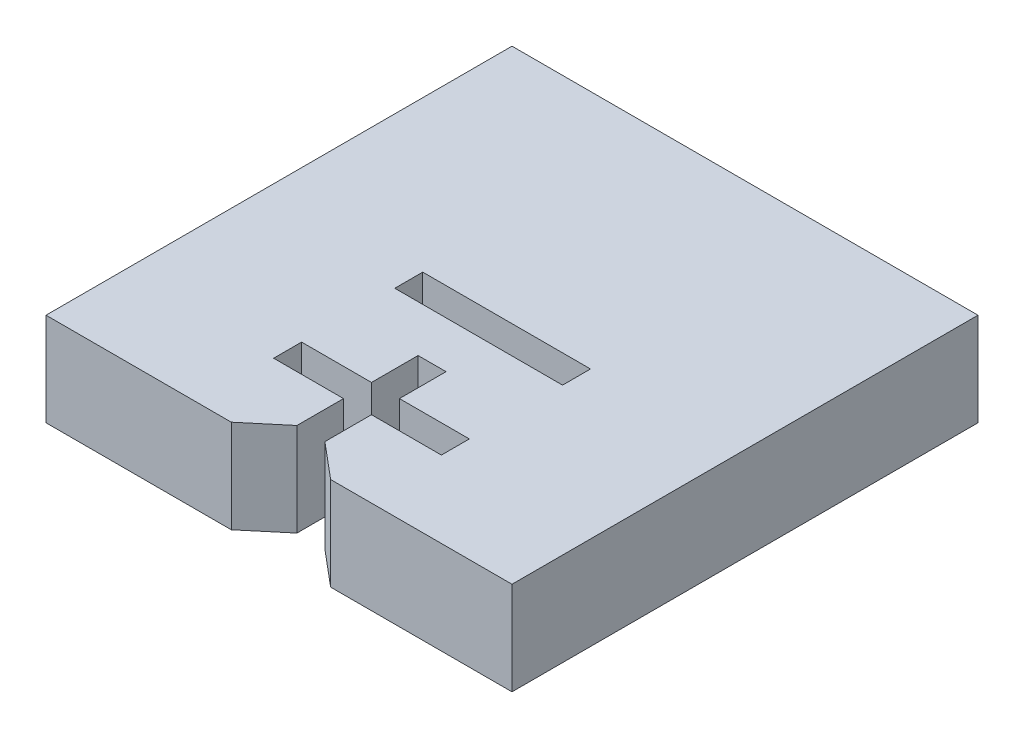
ISO-10303-21;
HEADER;
FILE_DESCRIPTION(('STEP AP214'),'2;1');
FILE_NAME('part.step','',(''),(''),'','','');
FILE_SCHEMA(('AUTOMOTIVE_DESIGN { 1 0 10303 214 1 1 1 1 }'));
ENDSEC;
DATA;
#1=APPLICATION_CONTEXT('core data for automotive mechanical design processes');
#2=APPLICATION_PROTOCOL_DEFINITION('international standard','automotive_design',2000,#1);
#3=PRODUCT_CONTEXT('',#1,'mechanical');
#4=PRODUCT('Part','Part','',(#3));
#5=PRODUCT_RELATED_PRODUCT_CATEGORY('part','',(#4));
#6=PRODUCT_DEFINITION_FORMATION('','',#4);
#7=PRODUCT_DEFINITION_CONTEXT('part definition',#1,'design');
#8=PRODUCT_DEFINITION('design','',#6,#7);
#9=PRODUCT_DEFINITION_SHAPE('','',#8);
#10=(LENGTH_UNIT() NAMED_UNIT(*) SI_UNIT(.MILLI.,.METRE.));
#11=(NAMED_UNIT(*) PLANE_ANGLE_UNIT() SI_UNIT($,.RADIAN.));
#12=(NAMED_UNIT(*) SI_UNIT($,.STERADIAN.) SOLID_ANGLE_UNIT());
#13=UNCERTAINTY_MEASURE_WITH_UNIT(LENGTH_MEASURE(1.E-05),#10,'distance_accuracy_value','');
#14=(GEOMETRIC_REPRESENTATION_CONTEXT(3) GLOBAL_UNCERTAINTY_ASSIGNED_CONTEXT((#13)) GLOBAL_UNIT_ASSIGNED_CONTEXT((#10,
#11,#12)) REPRESENTATION_CONTEXT('',''));
#15=CARTESIAN_POINT('',(0.,0.,0.));
#16=DIRECTION('',(0.,0.,1.));
#17=DIRECTION('',(1.,0.,0.));
#18=AXIS2_PLACEMENT_3D('',#15,#16,#17);
#19=CARTESIAN_POINT('',(0.,10.,-54.5836991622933));
#20=DIRECTION('',(0.,0.,-1.));
#21=DIRECTION('',(-1.,0.,0.));
#22=AXIS2_PLACEMENT_3D('',#19,#20,#21);
#23=PLANE('',#22);
#24=DIRECTION('',(1.,0.,0.));
#25=VECTOR('',#24,1.);
#26=CARTESIAN_POINT('',(0.,0.,-54.5836991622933));
#27=LINE('',#26,#25);
#28=CARTESIAN_POINT('',(-30.9988969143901,0.,-54.5836991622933));
#29=VERTEX_POINT('',#28);
#30=CARTESIAN_POINT('',(-11.1193788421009,0.,-54.5836991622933));
#31=VERTEX_POINT('',#30);
#32=EDGE_CURVE('E233',#29,#31,#27,.T.);
#33=ORIENTED_EDGE('',*,*,#32,.T.);
#34=DIRECTION('',(0.,-1.,0.));
#35=VECTOR('',#34,1.);
#36=CARTESIAN_POINT('',(-11.1193788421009,10.,-54.5836991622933));
#37=LINE('',#36,#35);
#38=CARTESIAN_POINT('',(-11.1193788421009,10.,-54.5836991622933));
#39=VERTEX_POINT('',#38);
#40=EDGE_CURVE('E11',#39,#31,#37,.T.);
#41=ORIENTED_EDGE('',*,*,#40,.F.);
#42=DIRECTION('',(1.,0.,0.));
#43=VECTOR('',#42,1.);
#44=CARTESIAN_POINT('',(0.,10.,-54.5836991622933));
#45=LINE('',#44,#43);
#46=CARTESIAN_POINT('',(-30.9988969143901,10.,-54.5836991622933));
#47=VERTEX_POINT('',#46);
#48=EDGE_CURVE('E422',#47,#39,#45,.T.);
#49=ORIENTED_EDGE('',*,*,#48,.F.);
#50=DIRECTION('',(0.,-1.,0.));
#51=VECTOR('',#50,1.);
#52=CARTESIAN_POINT('',(-30.9988969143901,10.,-54.5836991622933));
#53=LINE('',#52,#51);
#54=EDGE_CURVE('E54',#47,#29,#53,.T.);
#55=ORIENTED_EDGE('',*,*,#54,.T.);
#56=EDGE_LOOP('',(#33,#41,#49,#55));
#57=FACE_BOUND('',#56,.T.);
#58=ADVANCED_FACE('F35',(#57),#23,.F.);
#59=CARTESIAN_POINT('',(-31.4714845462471,10.,-37.5062547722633));
#60=DIRECTION('',(-0.642787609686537,0.,-0.76604444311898));
#61=DIRECTION('',(-0.76604444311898,0.,0.642787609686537));
#62=AXIS2_PLACEMENT_3D('',#59,#60,#61);
#63=PLANE('',#62);
#64=DIRECTION('',(0.76604444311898,0.,-0.642787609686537));
#65=VECTOR('',#64,1.);
#66=CARTESIAN_POINT('',(-31.4714845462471,0.,-37.5062547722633));
#67=LINE('',#66,#65);
#68=CARTESIAN_POINT('',(-7.28915662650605,0.,-57.797637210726));
#69=VERTEX_POINT('',#68);
#70=EDGE_CURVE('E235',#31,#69,#67,.T.);
#71=ORIENTED_EDGE('',*,*,#70,.T.);
#72=DIRECTION('',(0.,-1.,0.));
#73=VECTOR('',#72,1.);
#74=CARTESIAN_POINT('',(-7.28915662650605,10.,-57.797637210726));
#75=LINE('',#74,#73);
#76=CARTESIAN_POINT('',(-7.28915662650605,10.,-57.797637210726));
#77=VERTEX_POINT('',#76);
#78=EDGE_CURVE('E45',#77,#69,#75,.T.);
#79=ORIENTED_EDGE('',*,*,#78,.F.);
#80=DIRECTION('',(0.76604444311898,0.,-0.642787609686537));
#81=VECTOR('',#80,1.);
#82=CARTESIAN_POINT('',(-31.4714845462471,10.,-37.5062547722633));
#83=LINE('',#82,#81);
#84=EDGE_CURVE('E424',#39,#77,#83,.T.);
#85=ORIENTED_EDGE('',*,*,#84,.F.);
#86=ORIENTED_EDGE('',*,*,#40,.T.);
#87=EDGE_LOOP('',(#71,#79,#85,#86));
#88=FACE_BOUND('',#87,.T.);
#89=ADVANCED_FACE('F344',(#88),#63,.F.);
#90=CARTESIAN_POINT('',(-7.28915662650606,10.,0.));
#91=DIRECTION('',(-1.,0.,0.));
#92=DIRECTION('',(0.,0.,1.));
#93=AXIS2_PLACEMENT_3D('',#90,#91,#92);
#94=PLANE('',#93);
#95=DIRECTION('',(0.,0.,-1.));
#96=VECTOR('',#95,1.);
#97=CARTESIAN_POINT('',(-7.28915662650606,0.,0.));
#98=LINE('',#97,#96);
#99=CARTESIAN_POINT('',(-7.28915662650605,0.,-62.797637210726));
#100=VERTEX_POINT('',#99);
#101=EDGE_CURVE('E237',#69,#100,#98,.T.);
#102=ORIENTED_EDGE('',*,*,#101,.T.);
#103=DIRECTION('',(0.,-1.,0.));
#104=VECTOR('',#103,1.);
#105=CARTESIAN_POINT('',(-7.28915662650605,10.,-62.797637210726));
#106=LINE('',#105,#104);
#107=CARTESIAN_POINT('',(-7.28915662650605,10.,-62.797637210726));
#108=VERTEX_POINT('',#107);
#109=EDGE_CURVE('E306',#108,#100,#106,.T.);
#110=ORIENTED_EDGE('',*,*,#109,.F.);
#111=DIRECTION('',(0.,0.,-1.));
#112=VECTOR('',#111,1.);
#113=CARTESIAN_POINT('',(-7.28915662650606,10.,0.));
#114=LINE('',#113,#112);
#115=EDGE_CURVE('E426',#77,#108,#114,.T.);
#116=ORIENTED_EDGE('',*,*,#115,.F.);
#117=ORIENTED_EDGE('',*,*,#78,.T.);
#118=EDGE_LOOP('',(#102,#110,#116,#117));
#119=FACE_BOUND('',#118,.T.);
#120=ADVANCED_FACE('F349',(#119),#94,.F.);
#121=CARTESIAN_POINT('',(0.,10.,-62.797637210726));
#122=DIRECTION('',(0.,0.,1.));
#123=DIRECTION('',(1.,0.,0.));
#124=AXIS2_PLACEMENT_3D('',#121,#122,#123);
#125=PLANE('',#124);
#126=DIRECTION('',(-1.,0.,0.));
#127=VECTOR('',#126,1.);
#128=CARTESIAN_POINT('',(0.,0.,-62.797637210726));
#129=LINE('',#128,#127);
#130=CARTESIAN_POINT('',(-14.789156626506,0.,-62.797637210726));
#131=VERTEX_POINT('',#130);
#132=EDGE_CURVE('E239',#100,#131,#129,.T.);
#133=ORIENTED_EDGE('',*,*,#132,.T.);
#134=DIRECTION('',(0.,-1.,0.));
#135=VECTOR('',#134,1.);
#136=CARTESIAN_POINT('',(-14.789156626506,10.,-62.797637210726));
#137=LINE('',#136,#135);
#138=CARTESIAN_POINT('',(-14.789156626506,10.,-62.797637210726));
#139=VERTEX_POINT('',#138);
#140=EDGE_CURVE('E303',#139,#131,#137,.T.);
#141=ORIENTED_EDGE('',*,*,#140,.F.);
#142=DIRECTION('',(-1.,0.,0.));
#143=VECTOR('',#142,1.);
#144=CARTESIAN_POINT('',(0.,10.,-62.797637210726));
#145=LINE('',#144,#143);
#146=EDGE_CURVE('E428',#108,#139,#145,.T.);
#147=ORIENTED_EDGE('',*,*,#146,.F.);
#148=ORIENTED_EDGE('',*,*,#109,.T.);
#149=EDGE_LOOP('',(#133,#141,#147,#148));
#150=FACE_BOUND('',#149,.T.);
#151=ADVANCED_FACE('F355',(#150),#125,.F.);
#152=CARTESIAN_POINT('',(-14.789156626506,10.,0.));
#153=DIRECTION('',(-1.,0.,0.));
#154=DIRECTION('',(0.,0.,1.));
#155=AXIS2_PLACEMENT_3D('',#152,#153,#154);
#156=PLANE('',#155);
#157=DIRECTION('',(0.,0.,-1.));
#158=VECTOR('',#157,1.);
#159=CARTESIAN_POINT('',(-14.789156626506,0.,0.));
#160=LINE('',#159,#158);
#161=CARTESIAN_POINT('',(-14.789156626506,0.,-65.797637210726));
#162=VERTEX_POINT('',#161);
#163=EDGE_CURVE('E241',#131,#162,#160,.T.);
#164=ORIENTED_EDGE('',*,*,#163,.T.);
#165=DIRECTION('',(0.,-1.,0.));
#166=VECTOR('',#165,1.);
#167=CARTESIAN_POINT('',(-14.789156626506,10.,-65.797637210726));
#168=LINE('',#167,#166);
#169=CARTESIAN_POINT('',(-14.789156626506,10.,-65.797637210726));
#170=VERTEX_POINT('',#169);
#171=EDGE_CURVE('E300',#170,#162,#168,.T.);
#172=ORIENTED_EDGE('',*,*,#171,.F.);
#173=DIRECTION('',(0.,0.,-1.));
#174=VECTOR('',#173,1.);
#175=CARTESIAN_POINT('',(-14.789156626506,10.,0.));
#176=LINE('',#175,#174);
#177=EDGE_CURVE('E430',#139,#170,#176,.T.);
#178=ORIENTED_EDGE('',*,*,#177,.F.);
#179=ORIENTED_EDGE('',*,*,#140,.T.);
#180=EDGE_LOOP('',(#164,#172,#178,#179));
#181=FACE_BOUND('',#180,.T.);
#182=ADVANCED_FACE('F359',(#181),#156,.F.);
#183=CARTESIAN_POINT('',(0.,10.,-65.797637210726));
#184=DIRECTION('',(0.,0.,-1.));
#185=DIRECTION('',(-1.,0.,0.));
#186=AXIS2_PLACEMENT_3D('',#183,#184,#185);
#187=PLANE('',#186);
#188=DIRECTION('',(1.,0.,0.));
#189=VECTOR('',#188,1.);
#190=CARTESIAN_POINT('',(0.,0.,-65.797637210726));
#191=LINE('',#190,#189);
#192=CARTESIAN_POINT('',(-7.28915662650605,0.,-65.797637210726));
#193=VERTEX_POINT('',#192);
#194=EDGE_CURVE('E243',#162,#193,#191,.T.);
#195=ORIENTED_EDGE('',*,*,#194,.T.);
#196=DIRECTION('',(0.,-1.,0.));
#197=VECTOR('',#196,1.);
#198=CARTESIAN_POINT('',(-7.28915662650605,10.,-65.797637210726));
#199=LINE('',#198,#197);
#200=CARTESIAN_POINT('',(-7.28915662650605,10.,-65.797637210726));
#201=VERTEX_POINT('',#200);
#202=EDGE_CURVE('E297',#201,#193,#199,.T.);
#203=ORIENTED_EDGE('',*,*,#202,.F.);
#204=DIRECTION('',(1.,0.,0.));
#205=VECTOR('',#204,1.);
#206=CARTESIAN_POINT('',(0.,10.,-65.797637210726));
#207=LINE('',#206,#205);
#208=EDGE_CURVE('E432',#170,#201,#207,.T.);
#209=ORIENTED_EDGE('',*,*,#208,.F.);
#210=ORIENTED_EDGE('',*,*,#171,.T.);
#211=EDGE_LOOP('',(#195,#203,#209,#210));
#212=FACE_BOUND('',#211,.T.);
#213=ADVANCED_FACE('F363',(#212),#187,.F.);
#214=CARTESIAN_POINT('',(-7.28915662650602,10.,0.));
#215=DIRECTION('',(-1.,0.,0.));
#216=DIRECTION('',(0.,0.,1.));
#217=AXIS2_PLACEMENT_3D('',#214,#215,#216);
#218=PLANE('',#217);
#219=DIRECTION('',(0.,0.,-1.));
#220=VECTOR('',#219,1.);
#221=CARTESIAN_POINT('',(-7.28915662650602,0.,0.));
#222=LINE('',#221,#220);
#223=CARTESIAN_POINT('',(-7.28915662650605,0.,-70.797637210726));
#224=VERTEX_POINT('',#223);
#225=EDGE_CURVE('E245',#193,#224,#222,.T.);
#226=ORIENTED_EDGE('',*,*,#225,.T.);
#227=DIRECTION('',(0.,-1.,0.));
#228=VECTOR('',#227,1.);
#229=CARTESIAN_POINT('',(-7.28915662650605,10.,-70.797637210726));
#230=LINE('',#229,#228);
#231=CARTESIAN_POINT('',(-7.28915662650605,10.,-70.797637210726));
#232=VERTEX_POINT('',#231);
#233=EDGE_CURVE('E294',#232,#224,#230,.T.);
#234=ORIENTED_EDGE('',*,*,#233,.F.);
#235=DIRECTION('',(0.,0.,-1.));
#236=VECTOR('',#235,1.);
#237=CARTESIAN_POINT('',(-7.28915662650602,10.,0.));
#238=LINE('',#237,#236);
#239=EDGE_CURVE('E434',#201,#232,#238,.T.);
#240=ORIENTED_EDGE('',*,*,#239,.F.);
#241=ORIENTED_EDGE('',*,*,#202,.T.);
#242=EDGE_LOOP('',(#226,#234,#240,#241));
#243=FACE_BOUND('',#242,.T.);
#244=ADVANCED_FACE('F367',(#243),#218,.F.);
#245=CARTESIAN_POINT('',(3.2750486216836E-13,10.,-70.7976372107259));
#246=DIRECTION('',(0.,0.,-1.));
#247=DIRECTION('',(-1.,0.,0.));
#248=AXIS2_PLACEMENT_3D('',#245,#246,#247);
#249=PLANE('',#248);
#250=DIRECTION('',(1.,0.,0.));
#251=VECTOR('',#250,1.);
#252=CARTESIAN_POINT('',(3.2750486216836E-13,0.,-70.7976372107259));
#253=LINE('',#252,#251);
#254=CARTESIAN_POINT('',(-4.28915662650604,0.,-70.7976372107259));
#255=VERTEX_POINT('',#254);
#256=EDGE_CURVE('E247',#224,#255,#253,.T.);
#257=ORIENTED_EDGE('',*,*,#256,.T.);
#258=DIRECTION('',(0.,-1.,0.));
#259=VECTOR('',#258,1.);
#260=CARTESIAN_POINT('',(-4.28915662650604,10.,-70.7976372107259));
#261=LINE('',#260,#259);
#262=CARTESIAN_POINT('',(-4.28915662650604,10.,-70.7976372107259));
#263=VERTEX_POINT('',#262);
#264=EDGE_CURVE('E292',#263,#255,#261,.T.);
#265=ORIENTED_EDGE('',*,*,#264,.F.);
#266=DIRECTION('',(1.,0.,0.));
#267=VECTOR('',#266,1.);
#268=CARTESIAN_POINT('',(3.2750486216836E-13,10.,-70.7976372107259));
#269=LINE('',#268,#267);
#270=EDGE_CURVE('E436',#232,#263,#269,.T.);
#271=ORIENTED_EDGE('',*,*,#270,.F.);
#272=ORIENTED_EDGE('',*,*,#233,.T.);
#273=EDGE_LOOP('',(#257,#265,#271,#272));
#274=FACE_BOUND('',#273,.T.);
#275=ADVANCED_FACE('F371',(#274),#249,.F.);
#276=CARTESIAN_POINT('',(-4.28915662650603,10.,0.));
#277=DIRECTION('',(-1.,0.,0.));
#278=DIRECTION('',(0.,0.,1.));
#279=AXIS2_PLACEMENT_3D('',#276,#277,#278);
#280=PLANE('',#279);
#281=DIRECTION('',(0.,0.,-1.));
#282=VECTOR('',#281,1.);
#283=CARTESIAN_POINT('',(-4.28915662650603,0.,0.));
#284=LINE('',#283,#282);
#285=CARTESIAN_POINT('',(-4.28915662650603,0.,-65.7976372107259));
#286=VERTEX_POINT('',#285);
#287=EDGE_CURVE('E250',#286,#255,#284,.T.);
#288=ORIENTED_EDGE('',*,*,#287,.F.);
#289=DIRECTION('',(0.,-1.,0.));
#290=VECTOR('',#289,1.);
#291=CARTESIAN_POINT('',(-4.28915662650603,10.,-65.7976372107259));
#292=LINE('',#291,#290);
#293=CARTESIAN_POINT('',(-4.28915662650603,10.,-65.7976372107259));
#294=VERTEX_POINT('',#293);
#295=EDGE_CURVE('E290',#294,#286,#292,.T.);
#296=ORIENTED_EDGE('',*,*,#295,.F.);
#297=DIRECTION('',(0.,0.,-1.));
#298=VECTOR('',#297,1.);
#299=CARTESIAN_POINT('',(-4.28915662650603,10.,0.));
#300=LINE('',#299,#298);
#301=EDGE_CURVE('E438',#294,#263,#300,.T.);
#302=ORIENTED_EDGE('',*,*,#301,.T.);
#303=ORIENTED_EDGE('',*,*,#264,.T.);
#304=EDGE_LOOP('',(#288,#296,#302,#303));
#305=FACE_BOUND('',#304,.T.);
#306=ADVANCED_FACE('F375',(#305),#280,.T.);
#307=CARTESIAN_POINT('',(0.,10.,-65.7976372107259));
#308=DIRECTION('',(0.,0.,1.));
#309=DIRECTION('',(1.,0.,0.));
#310=AXIS2_PLACEMENT_3D('',#307,#308,#309);
#311=PLANE('',#310);
#312=DIRECTION('',(-1.,0.,0.));
#313=VECTOR('',#312,1.);
#314=CARTESIAN_POINT('',(0.,0.,-65.7976372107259));
#315=LINE('',#314,#313);
#316=CARTESIAN_POINT('',(3.21084337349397,0.,-65.7976372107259));
#317=VERTEX_POINT('',#316);
#318=EDGE_CURVE('E253',#317,#286,#315,.T.);
#319=ORIENTED_EDGE('',*,*,#318,.F.);
#320=DIRECTION('',(0.,-1.,0.));
#321=VECTOR('',#320,1.);
#322=CARTESIAN_POINT('',(3.21084337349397,10.,-65.7976372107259));
#323=LINE('',#322,#321);
#324=CARTESIAN_POINT('',(3.21084337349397,10.,-65.7976372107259));
#325=VERTEX_POINT('',#324);
#326=EDGE_CURVE('E288',#325,#317,#323,.T.);
#327=ORIENTED_EDGE('',*,*,#326,.F.);
#328=DIRECTION('',(-1.,0.,0.));
#329=VECTOR('',#328,1.);
#330=CARTESIAN_POINT('',(0.,10.,-65.7976372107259));
#331=LINE('',#330,#329);
#332=EDGE_CURVE('E441',#325,#294,#331,.T.);
#333=ORIENTED_EDGE('',*,*,#332,.T.);
#334=ORIENTED_EDGE('',*,*,#295,.T.);
#335=EDGE_LOOP('',(#319,#327,#333,#334));
#336=FACE_BOUND('',#335,.T.);
#337=ADVANCED_FACE('F379',(#336),#311,.T.);
#338=CARTESIAN_POINT('',(3.21084337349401,10.,0.));
#339=DIRECTION('',(-1.,0.,0.));
#340=DIRECTION('',(0.,0.,1.));
#341=AXIS2_PLACEMENT_3D('',#338,#339,#340);
#342=PLANE('',#341);
#343=DIRECTION('',(0.,0.,-1.));
#344=VECTOR('',#343,1.);
#345=CARTESIAN_POINT('',(3.21084337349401,0.,0.));
#346=LINE('',#345,#344);
#347=CARTESIAN_POINT('',(3.21084337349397,0.,-62.7976372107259));
#348=VERTEX_POINT('',#347);
#349=EDGE_CURVE('E256',#348,#317,#346,.T.);
#350=ORIENTED_EDGE('',*,*,#349,.F.);
#351=DIRECTION('',(0.,-1.,0.));
#352=VECTOR('',#351,1.);
#353=CARTESIAN_POINT('',(3.21084337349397,10.,-62.7976372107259));
#354=LINE('',#353,#352);
#355=CARTESIAN_POINT('',(3.21084337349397,10.,-62.7976372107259));
#356=VERTEX_POINT('',#355);
#357=EDGE_CURVE('E286',#356,#348,#354,.T.);
#358=ORIENTED_EDGE('',*,*,#357,.F.);
#359=DIRECTION('',(0.,0.,-1.));
#360=VECTOR('',#359,1.);
#361=CARTESIAN_POINT('',(3.21084337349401,10.,0.));
#362=LINE('',#361,#360);
#363=EDGE_CURVE('E444',#356,#325,#362,.T.);
#364=ORIENTED_EDGE('',*,*,#363,.T.);
#365=ORIENTED_EDGE('',*,*,#326,.T.);
#366=EDGE_LOOP('',(#350,#358,#364,#365));
#367=FACE_BOUND('',#366,.T.);
#368=ADVANCED_FACE('F383',(#367),#342,.T.);
#369=CARTESIAN_POINT('',(0.,10.,-62.7976372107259));
#370=DIRECTION('',(0.,0.,-1.));
#371=DIRECTION('',(-1.,0.,0.));
#372=AXIS2_PLACEMENT_3D('',#369,#370,#371);
#373=PLANE('',#372);
#374=DIRECTION('',(1.,0.,0.));
#375=VECTOR('',#374,1.);
#376=CARTESIAN_POINT('',(0.,0.,-62.7976372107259));
#377=LINE('',#376,#375);
#378=CARTESIAN_POINT('',(-4.28915662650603,0.,-62.7976372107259));
#379=VERTEX_POINT('',#378);
#380=EDGE_CURVE('E259',#379,#348,#377,.T.);
#381=ORIENTED_EDGE('',*,*,#380,.F.);
#382=DIRECTION('',(0.,-1.,0.));
#383=VECTOR('',#382,1.);
#384=CARTESIAN_POINT('',(-4.28915662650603,10.,-62.7976372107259));
#385=LINE('',#384,#383);
#386=CARTESIAN_POINT('',(-4.28915662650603,10.,-62.7976372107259));
#387=VERTEX_POINT('',#386);
#388=EDGE_CURVE('E284',#387,#379,#385,.T.);
#389=ORIENTED_EDGE('',*,*,#388,.F.);
#390=DIRECTION('',(1.,0.,0.));
#391=VECTOR('',#390,1.);
#392=CARTESIAN_POINT('',(0.,10.,-62.7976372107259));
#393=LINE('',#392,#391);
#394=EDGE_CURVE('E447',#387,#356,#393,.T.);
#395=ORIENTED_EDGE('',*,*,#394,.T.);
#396=ORIENTED_EDGE('',*,*,#357,.T.);
#397=EDGE_LOOP('',(#381,#389,#395,#396));
#398=FACE_BOUND('',#397,.T.);
#399=ADVANCED_FACE('F387',(#398),#373,.T.);
#400=CARTESIAN_POINT('',(-4.28915662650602,10.,0.));
#401=DIRECTION('',(-1.,0.,0.));
#402=DIRECTION('',(0.,0.,1.));
#403=AXIS2_PLACEMENT_3D('',#400,#401,#402);
#404=PLANE('',#403);
#405=DIRECTION('',(0.,0.,-1.));
#406=VECTOR('',#405,1.);
#407=CARTESIAN_POINT('',(-4.28915662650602,0.,0.));
#408=LINE('',#407,#406);
#409=CARTESIAN_POINT('',(-4.28915662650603,0.,-57.7976372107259));
#410=VERTEX_POINT('',#409);
#411=EDGE_CURVE('E262',#410,#379,#408,.T.);
#412=ORIENTED_EDGE('',*,*,#411,.F.);
#413=DIRECTION('',(0.,-1.,0.));
#414=VECTOR('',#413,1.);
#415=CARTESIAN_POINT('',(-4.28915662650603,10.,-57.7976372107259));
#416=LINE('',#415,#414);
#417=CARTESIAN_POINT('',(-4.28915662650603,10.,-57.7976372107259));
#418=VERTEX_POINT('',#417);
#419=EDGE_CURVE('E282',#418,#410,#416,.T.);
#420=ORIENTED_EDGE('',*,*,#419,.F.);
#421=DIRECTION('',(0.,0.,-1.));
#422=VECTOR('',#421,1.);
#423=CARTESIAN_POINT('',(-4.28915662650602,10.,0.));
#424=LINE('',#423,#422);
#425=EDGE_CURVE('E450',#418,#387,#424,.T.);
#426=ORIENTED_EDGE('',*,*,#425,.T.);
#427=ORIENTED_EDGE('',*,*,#388,.T.);
#428=EDGE_LOOP('',(#412,#420,#426,#427));
#429=FACE_BOUND('',#428,.T.);
#430=ADVANCED_FACE('F391',(#429),#404,.T.);
#431=CARTESIAN_POINT('',(26.6876044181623,10.,-31.8050484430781));
#432=DIRECTION('',(-0.642787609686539,0.,0.766044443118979));
#433=DIRECTION('',(0.766044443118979,0.,0.642787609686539));
#434=AXIS2_PLACEMENT_3D('',#431,#432,#433);
#435=PLANE('',#434);
#436=DIRECTION('',(-0.766044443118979,0.,-0.642787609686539));
#437=VECTOR('',#436,1.);
#438=CARTESIAN_POINT('',(26.6876044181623,0.,-31.8050484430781));
#439=LINE('',#438,#437);
#440=CARTESIAN_POINT('',(-0.458934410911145,0.,-54.5836991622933));
#441=VERTEX_POINT('',#440);
#442=EDGE_CURVE('E265',#441,#410,#439,.T.);
#443=ORIENTED_EDGE('',*,*,#442,.F.);
#444=DIRECTION('',(0.,-1.,0.));
#445=VECTOR('',#444,1.);
#446=CARTESIAN_POINT('',(-0.458934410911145,10.,-54.5836991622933));
#447=LINE('',#446,#445);
#448=CARTESIAN_POINT('',(-0.458934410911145,10.,-54.5836991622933));
#449=VERTEX_POINT('',#448);
#450=EDGE_CURVE('E280',#449,#441,#447,.T.);
#451=ORIENTED_EDGE('',*,*,#450,.F.);
#452=DIRECTION('',(-0.766044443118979,0.,-0.642787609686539));
#453=VECTOR('',#452,1.);
#454=CARTESIAN_POINT('',(26.6876044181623,10.,-31.8050484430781));
#455=LINE('',#454,#453);
#456=EDGE_CURVE('E453',#449,#418,#455,.T.);
#457=ORIENTED_EDGE('',*,*,#456,.T.);
#458=ORIENTED_EDGE('',*,*,#419,.T.);
#459=EDGE_LOOP('',(#443,#451,#457,#458));
#460=FACE_BOUND('',#459,.T.);
#461=ADVANCED_FACE('F395',(#460),#435,.T.);
#462=CARTESIAN_POINT('',(0.,10.,-54.5836991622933));
#463=DIRECTION('',(0.,0.,-1.));
#464=DIRECTION('',(-1.,0.,0.));
#465=AXIS2_PLACEMENT_3D('',#462,#463,#464);
#466=PLANE('',#465);
#467=DIRECTION('',(1.,0.,0.));
#468=VECTOR('',#467,1.);
#469=CARTESIAN_POINT('',(0.,0.,-54.5836991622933));
#470=LINE('',#469,#468);
#471=CARTESIAN_POINT('',(19.0011030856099,0.,-54.5836991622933));
#472=VERTEX_POINT('',#471);
#473=EDGE_CURVE('E268',#441,#472,#470,.T.);
#474=ORIENTED_EDGE('',*,*,#473,.T.);
#475=DIRECTION('',(0.,-1.,0.));
#476=VECTOR('',#475,1.);
#477=CARTESIAN_POINT('',(19.0011030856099,10.,-54.5836991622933));
#478=LINE('',#477,#476);
#479=CARTESIAN_POINT('',(19.0011030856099,10.,-54.5836991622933));
#480=VERTEX_POINT('',#479);
#481=EDGE_CURVE('E213',#480,#472,#478,.T.);
#482=ORIENTED_EDGE('',*,*,#481,.F.);
#483=DIRECTION('',(1.,0.,0.));
#484=VECTOR('',#483,1.);
#485=CARTESIAN_POINT('',(0.,10.,-54.5836991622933));
#486=LINE('',#485,#484);
#487=EDGE_CURVE('E201',#449,#480,#486,.T.);
#488=ORIENTED_EDGE('',*,*,#487,.F.);
#489=ORIENTED_EDGE('',*,*,#450,.T.);
#490=EDGE_LOOP('',(#474,#482,#488,#489));
#491=FACE_BOUND('',#490,.T.);
#492=ADVANCED_FACE('F399',(#491),#466,.F.);
#493=CARTESIAN_POINT('',(19.0011030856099,10.,0.));
#494=DIRECTION('',(-1.,0.,0.));
#495=DIRECTION('',(0.,0.,1.));
#496=AXIS2_PLACEMENT_3D('',#493,#494,#495);
#497=PLANE('',#496);
#498=DIRECTION('',(0.,0.,-1.));
#499=VECTOR('',#498,1.);
#500=CARTESIAN_POINT('',(19.0011030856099,0.,0.));
#501=LINE('',#500,#499);
#502=CARTESIAN_POINT('',(19.0011030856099,0.,-104.583699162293));
#503=VERTEX_POINT('',#502);
#504=EDGE_CURVE('E210',#472,#503,#501,.T.);
#505=ORIENTED_EDGE('',*,*,#504,.T.);
#506=DIRECTION('',(0.,-1.,0.));
#507=VECTOR('',#506,1.);
#508=CARTESIAN_POINT('',(19.0011030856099,10.,-104.583699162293));
#509=LINE('',#508,#507);
#510=CARTESIAN_POINT('',(19.0011030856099,10.,-104.583699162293));
#511=VERTEX_POINT('',#510);
#512=EDGE_CURVE('E207',#511,#503,#509,.T.);
#513=ORIENTED_EDGE('',*,*,#512,.F.);
#514=DIRECTION('',(0.,0.,-1.));
#515=VECTOR('',#514,1.);
#516=CARTESIAN_POINT('',(19.0011030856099,10.,0.));
#517=LINE('',#516,#515);
#518=EDGE_CURVE('E192',#480,#511,#517,.T.);
#519=ORIENTED_EDGE('',*,*,#518,.F.);
#520=ORIENTED_EDGE('',*,*,#481,.T.);
#521=EDGE_LOOP('',(#505,#513,#519,#520));
#522=FACE_BOUND('',#521,.T.);
#523=ADVANCED_FACE('F208',(#522),#497,.F.);
#524=CARTESIAN_POINT('',(0.,10.,-104.583699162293));
#525=DIRECTION('',(0.,0.,-1.));
#526=DIRECTION('',(-1.,0.,0.));
#527=AXIS2_PLACEMENT_3D('',#524,#525,#526);
#528=PLANE('',#527);
#529=DIRECTION('',(1.,0.,0.));
#530=VECTOR('',#529,1.);
#531=CARTESIAN_POINT('',(0.,0.,-104.583699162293));
#532=LINE('',#531,#530);
#533=CARTESIAN_POINT('',(-30.9988969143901,0.,-104.583699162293));
#534=VERTEX_POINT('',#533);
#535=EDGE_CURVE('E271',#534,#503,#532,.T.);
#536=ORIENTED_EDGE('',*,*,#535,.F.);
#537=DIRECTION('',(0.,-1.,0.));
#538=VECTOR('',#537,1.);
#539=CARTESIAN_POINT('',(-30.9988969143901,10.,-104.583699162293));
#540=LINE('',#539,#538);
#541=CARTESIAN_POINT('',(-30.9988969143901,10.,-104.583699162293));
#542=VERTEX_POINT('',#541);
#543=EDGE_CURVE('E122',#542,#534,#540,.T.);
#544=ORIENTED_EDGE('',*,*,#543,.F.);
#545=DIRECTION('',(1.,0.,0.));
#546=VECTOR('',#545,1.);
#547=CARTESIAN_POINT('',(0.,10.,-104.583699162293));
#548=LINE('',#547,#546);
#549=EDGE_CURVE('E198',#542,#511,#548,.T.);
#550=ORIENTED_EDGE('',*,*,#549,.T.);
#551=ORIENTED_EDGE('',*,*,#512,.T.);
#552=EDGE_LOOP('',(#536,#544,#550,#551));
#553=FACE_BOUND('',#552,.T.);
#554=ADVANCED_FACE('F215',(#553),#528,.T.);
#555=CARTESIAN_POINT('',(0.,10.,-75.797637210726));
#556=DIRECTION('',(0.,0.,-1.));
#557=DIRECTION('',(-1.,0.,0.));
#558=AXIS2_PLACEMENT_3D('',#555,#556,#557);
#559=PLANE('',#558);
#560=DIRECTION('',(1.,0.,0.));
#561=VECTOR('',#560,1.);
#562=CARTESIAN_POINT('',(0.,0.,-75.797637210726));
#563=LINE('',#562,#561);
#564=CARTESIAN_POINT('',(-14.789156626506,0.,-75.797637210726));
#565=VERTEX_POINT('',#564);
#566=CARTESIAN_POINT('',(3.21084337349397,0.,-75.797637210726));
#567=VERTEX_POINT('',#566);
#568=EDGE_CURVE('E222',#565,#567,#563,.T.);
#569=ORIENTED_EDGE('',*,*,#568,.F.);
#570=DIRECTION('',(0.,-1.,0.));
#571=VECTOR('',#570,1.);
#572=CARTESIAN_POINT('',(-14.789156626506,10.,-75.797637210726));
#573=LINE('',#572,#571);
#574=CARTESIAN_POINT('',(-14.789156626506,10.,-75.797637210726));
#575=VERTEX_POINT('',#574);
#576=EDGE_CURVE('E39',#575,#565,#573,.T.);
#577=ORIENTED_EDGE('',*,*,#576,.F.);
#578=DIRECTION('',(1.,0.,0.));
#579=VECTOR('',#578,1.);
#580=CARTESIAN_POINT('',(0.,10.,-75.797637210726));
#581=LINE('',#580,#579);
#582=CARTESIAN_POINT('',(3.21084337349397,10.,-75.797637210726));
#583=VERTEX_POINT('',#582);
#584=EDGE_CURVE('E276',#575,#583,#581,.T.);
#585=ORIENTED_EDGE('',*,*,#584,.T.);
#586=DIRECTION('',(0.,-1.,0.));
#587=VECTOR('',#586,1.);
#588=CARTESIAN_POINT('',(3.21084337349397,10.,-75.797637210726));
#589=LINE('',#588,#587);
#590=EDGE_CURVE('E218',#583,#567,#589,.T.);
#591=ORIENTED_EDGE('',*,*,#590,.T.);
#592=EDGE_LOOP('',(#569,#577,#585,#591));
#593=FACE_BOUND('',#592,.T.);
#594=ADVANCED_FACE('F37',(#593),#559,.T.);
#595=CARTESIAN_POINT('',(-14.789156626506,10.,0.));
#596=DIRECTION('',(-1.,0.,0.));
#597=DIRECTION('',(0.,0.,1.));
#598=AXIS2_PLACEMENT_3D('',#595,#596,#597);
#599=PLANE('',#598);
#600=DIRECTION('',(0.,0.,-1.));
#601=VECTOR('',#600,1.);
#602=CARTESIAN_POINT('',(-14.789156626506,0.,0.));
#603=LINE('',#602,#601);
#604=CARTESIAN_POINT('',(-14.789156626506,0.,-78.797637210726));
#605=VERTEX_POINT('',#604);
#606=EDGE_CURVE('E225',#565,#605,#603,.T.);
#607=ORIENTED_EDGE('',*,*,#606,.T.);
#608=DIRECTION('',(0.,-1.,0.));
#609=VECTOR('',#608,1.);
#610=CARTESIAN_POINT('',(-14.789156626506,10.,-78.797637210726));
#611=LINE('',#610,#609);
#612=CARTESIAN_POINT('',(-14.789156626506,10.,-78.797637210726));
#613=VERTEX_POINT('',#612);
#614=EDGE_CURVE('E313',#613,#605,#611,.T.);
#615=ORIENTED_EDGE('',*,*,#614,.F.);
#616=DIRECTION('',(0.,0.,-1.));
#617=VECTOR('',#616,1.);
#618=CARTESIAN_POINT('',(-14.789156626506,10.,0.));
#619=LINE('',#618,#617);
#620=EDGE_CURVE('E322',#575,#613,#619,.T.);
#621=ORIENTED_EDGE('',*,*,#620,.F.);
#622=ORIENTED_EDGE('',*,*,#576,.T.);
#623=EDGE_LOOP('',(#607,#615,#621,#622));
#624=FACE_BOUND('',#623,.T.);
#625=ADVANCED_FACE('F321',(#624),#599,.F.);
#626=CARTESIAN_POINT('',(0.,10.,-78.797637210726));
#627=DIRECTION('',(0.,0.,-1.));
#628=DIRECTION('',(-1.,0.,0.));
#629=AXIS2_PLACEMENT_3D('',#626,#627,#628);
#630=PLANE('',#629);
#631=DIRECTION('',(1.,0.,0.));
#632=VECTOR('',#631,1.);
#633=CARTESIAN_POINT('',(0.,0.,-78.797637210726));
#634=LINE('',#633,#632);
#635=CARTESIAN_POINT('',(3.21084337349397,0.,-78.797637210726));
#636=VERTEX_POINT('',#635);
#637=EDGE_CURVE('E227',#605,#636,#634,.T.);
#638=ORIENTED_EDGE('',*,*,#637,.T.);
#639=DIRECTION('',(0.,-1.,0.));
#640=VECTOR('',#639,1.);
#641=CARTESIAN_POINT('',(3.21084337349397,10.,-78.797637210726));
#642=LINE('',#641,#640);
#643=CARTESIAN_POINT('',(3.21084337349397,10.,-78.797637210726));
#644=VERTEX_POINT('',#643);
#645=EDGE_CURVE('E312',#644,#636,#642,.T.);
#646=ORIENTED_EDGE('',*,*,#645,.F.);
#647=DIRECTION('',(1.,0.,0.));
#648=VECTOR('',#647,1.);
#649=CARTESIAN_POINT('',(0.,10.,-78.797637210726));
#650=LINE('',#649,#648);
#651=EDGE_CURVE('E417',#613,#644,#650,.T.);
#652=ORIENTED_EDGE('',*,*,#651,.F.);
#653=ORIENTED_EDGE('',*,*,#614,.T.);
#654=EDGE_LOOP('',(#638,#646,#652,#653));
#655=FACE_BOUND('',#654,.T.);
#656=ADVANCED_FACE('F334',(#655),#630,.F.);
#657=CARTESIAN_POINT('',(3.21084337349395,10.,0.));
#658=DIRECTION('',(-1.,0.,0.));
#659=DIRECTION('',(0.,0.,1.));
#660=AXIS2_PLACEMENT_3D('',#657,#658,#659);
#661=PLANE('',#660);
#662=DIRECTION('',(0.,0.,-1.));
#663=VECTOR('',#662,1.);
#664=CARTESIAN_POINT('',(3.21084337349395,0.,0.));
#665=LINE('',#664,#663);
#666=EDGE_CURVE('E230',#567,#636,#665,.T.);
#667=ORIENTED_EDGE('',*,*,#666,.F.);
#668=ORIENTED_EDGE('',*,*,#590,.F.);
#669=DIRECTION('',(0.,0.,-1.));
#670=VECTOR('',#669,1.);
#671=CARTESIAN_POINT('',(3.21084337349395,10.,0.));
#672=LINE('',#671,#670);
#673=EDGE_CURVE('E332',#583,#644,#672,.T.);
#674=ORIENTED_EDGE('',*,*,#673,.T.);
#675=ORIENTED_EDGE('',*,*,#645,.T.);
#676=EDGE_LOOP('',(#667,#668,#674,#675));
#677=FACE_BOUND('',#676,.T.);
#678=ADVANCED_FACE('F331',(#677),#661,.T.);
#679=CARTESIAN_POINT('',(-30.9988969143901,10.,0.));
#680=DIRECTION('',(-1.,0.,0.));
#681=DIRECTION('',(0.,0.,1.));
#682=AXIS2_PLACEMENT_3D('',#679,#680,#681);
#683=PLANE('',#682);
#684=DIRECTION('',(0.,0.,-1.));
#685=VECTOR('',#684,1.);
#686=CARTESIAN_POINT('',(-30.9988969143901,0.,0.));
#687=LINE('',#686,#685);
#688=EDGE_CURVE('E273',#29,#534,#687,.T.);
#689=ORIENTED_EDGE('',*,*,#688,.F.);
#690=ORIENTED_EDGE('',*,*,#54,.F.);
#691=DIRECTION('',(0.,0.,-1.));
#692=VECTOR('',#691,1.);
#693=CARTESIAN_POINT('',(-30.9988969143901,10.,0.));
#694=LINE('',#693,#692);
#695=EDGE_CURVE('E216',#47,#542,#694,.T.);
#696=ORIENTED_EDGE('',*,*,#695,.T.);
#697=ORIENTED_EDGE('',*,*,#543,.T.);
#698=EDGE_LOOP('',(#689,#690,#696,#697));
#699=FACE_BOUND('',#698,.T.);
#700=ADVANCED_FACE('F341',(#699),#683,.T.);
#701=CARTESIAN_POINT('',(0.,10.,0.));
#702=DIRECTION('',(0.,1.,0.));
#703=DIRECTION('',(0.,0.,1.));
#704=AXIS2_PLACEMENT_3D('',#701,#702,#703);
#705=PLANE('',#704);
#706=ORIENTED_EDGE('',*,*,#584,.F.);
#707=ORIENTED_EDGE('',*,*,#620,.T.);
#708=ORIENTED_EDGE('',*,*,#651,.T.);
#709=ORIENTED_EDGE('',*,*,#673,.F.);
#710=EDGE_LOOP('',(#706,#707,#708,#709));
#711=FACE_BOUND('',#710,.T.);
#712=ORIENTED_EDGE('',*,*,#48,.T.);
#713=ORIENTED_EDGE('',*,*,#84,.T.);
#714=ORIENTED_EDGE('',*,*,#115,.T.);
#715=ORIENTED_EDGE('',*,*,#146,.T.);
#716=ORIENTED_EDGE('',*,*,#177,.T.);
#717=ORIENTED_EDGE('',*,*,#208,.T.);
#718=ORIENTED_EDGE('',*,*,#239,.T.);
#719=ORIENTED_EDGE('',*,*,#270,.T.);
#720=ORIENTED_EDGE('',*,*,#301,.F.);
#721=ORIENTED_EDGE('',*,*,#332,.F.);
#722=ORIENTED_EDGE('',*,*,#363,.F.);
#723=ORIENTED_EDGE('',*,*,#394,.F.);
#724=ORIENTED_EDGE('',*,*,#425,.F.);
#725=ORIENTED_EDGE('',*,*,#456,.F.);
#726=ORIENTED_EDGE('',*,*,#487,.T.);
#727=ORIENTED_EDGE('',*,*,#518,.T.);
#728=ORIENTED_EDGE('',*,*,#549,.F.);
#729=ORIENTED_EDGE('',*,*,#695,.F.);
#730=EDGE_LOOP('',(#712,#713,#714,#715,#716,#717,#718,#719,#720,#721,#722,#723,#724,#725,#726,
#727,#728,#729));
#731=FACE_BOUND('',#730,.T.);
#732=ADVANCED_FACE('F195',(#711,#731),#705,.T.);
#733=CARTESIAN_POINT('',(0.,0.,0.));
#734=DIRECTION('',(0.,1.,0.));
#735=DIRECTION('',(0.,0.,1.));
#736=AXIS2_PLACEMENT_3D('',#733,#734,#735);
#737=PLANE('',#736);
#738=ORIENTED_EDGE('',*,*,#568,.T.);
#739=ORIENTED_EDGE('',*,*,#666,.T.);
#740=ORIENTED_EDGE('',*,*,#637,.F.);
#741=ORIENTED_EDGE('',*,*,#606,.F.);
#742=EDGE_LOOP('',(#738,#739,#740,#741));
#743=FACE_BOUND('',#742,.T.);
#744=ORIENTED_EDGE('',*,*,#32,.F.);
#745=ORIENTED_EDGE('',*,*,#688,.T.);
#746=ORIENTED_EDGE('',*,*,#535,.T.);
#747=ORIENTED_EDGE('',*,*,#504,.F.);
#748=ORIENTED_EDGE('',*,*,#473,.F.);
#749=ORIENTED_EDGE('',*,*,#442,.T.);
#750=ORIENTED_EDGE('',*,*,#411,.T.);
#751=ORIENTED_EDGE('',*,*,#380,.T.);
#752=ORIENTED_EDGE('',*,*,#349,.T.);
#753=ORIENTED_EDGE('',*,*,#318,.T.);
#754=ORIENTED_EDGE('',*,*,#287,.T.);
#755=ORIENTED_EDGE('',*,*,#256,.F.);
#756=ORIENTED_EDGE('',*,*,#225,.F.);
#757=ORIENTED_EDGE('',*,*,#194,.F.);
#758=ORIENTED_EDGE('',*,*,#163,.F.);
#759=ORIENTED_EDGE('',*,*,#132,.F.);
#760=ORIENTED_EDGE('',*,*,#101,.F.);
#761=ORIENTED_EDGE('',*,*,#70,.F.);
#762=EDGE_LOOP('',(#744,#745,#746,#747,#748,#749,#750,#751,#752,#753,#754,#755,#756,#757,#758,
#759,#760,#761));
#763=FACE_BOUND('',#762,.T.);
#764=ADVANCED_FACE('F325',(#743,#763),#737,.F.);
#765=CLOSED_SHELL('',(#58,#89,#120,#151,#182,#213,#244,#275,#306,#337,#368,#399,#430,#461,#492,
#523,#554,#594,#625,#656,#678,#700,#732,#764));
#766=MANIFOLD_SOLID_BREP('B2',#765);
#767=ADVANCED_BREP_SHAPE_REPRESENTATION('',(#18,#766),#14);
#768=SHAPE_DEFINITION_REPRESENTATION(#9,#767);
ENDSEC;
END-ISO-10303-21;
